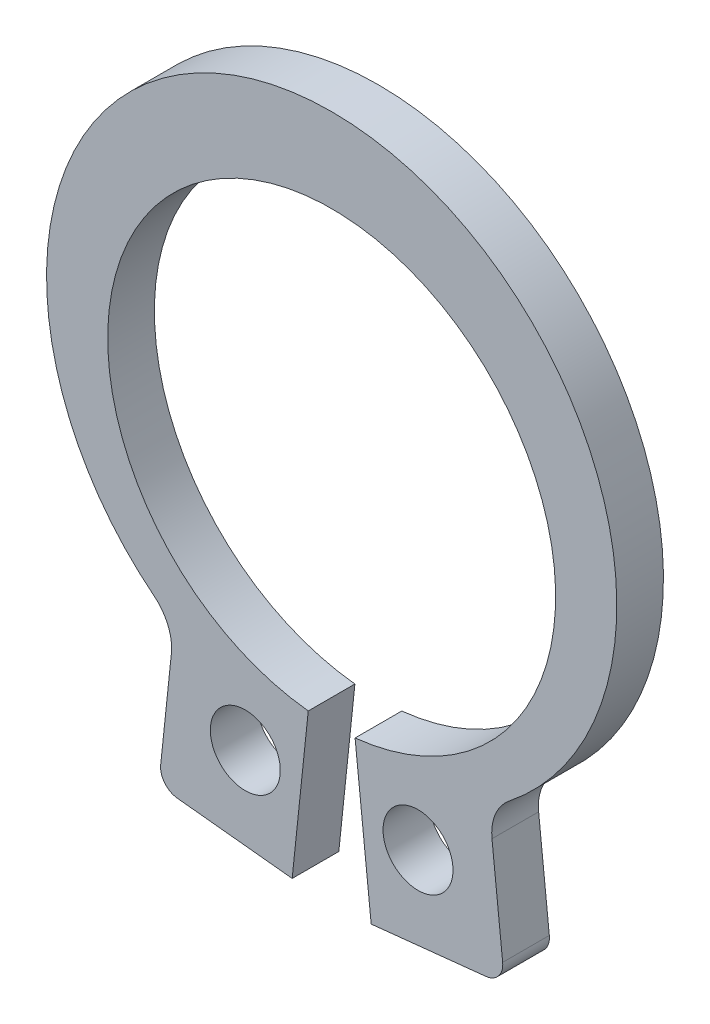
ISO-10303-21;
HEADER;
FILE_DESCRIPTION(('STEP AP214'),'2;1');
FILE_NAME('part.step','',(''),(''),'','','');
FILE_SCHEMA(('AUTOMOTIVE_DESIGN { 1 0 10303 214 1 1 1 1 }'));
ENDSEC;
DATA;
#1=APPLICATION_CONTEXT('core data for automotive mechanical design processes');
#2=APPLICATION_PROTOCOL_DEFINITION('international standard','automotive_design',2000,#1);
#3=PRODUCT_CONTEXT('',#1,'mechanical');
#4=PRODUCT('Part','Part','',(#3));
#5=PRODUCT_RELATED_PRODUCT_CATEGORY('part','',(#4));
#6=PRODUCT_DEFINITION_FORMATION('','',#4);
#7=PRODUCT_DEFINITION_CONTEXT('part definition',#1,'design');
#8=PRODUCT_DEFINITION('design','',#6,#7);
#9=PRODUCT_DEFINITION_SHAPE('','',#8);
#10=(LENGTH_UNIT() NAMED_UNIT(*) SI_UNIT(.MILLI.,.METRE.));
#11=(NAMED_UNIT(*) PLANE_ANGLE_UNIT() SI_UNIT($,.RADIAN.));
#12=(NAMED_UNIT(*) SI_UNIT($,.STERADIAN.) SOLID_ANGLE_UNIT());
#13=UNCERTAINTY_MEASURE_WITH_UNIT(LENGTH_MEASURE(1.E-05),#10,'distance_accuracy_value','');
#14=(GEOMETRIC_REPRESENTATION_CONTEXT(3) GLOBAL_UNCERTAINTY_ASSIGNED_CONTEXT((#13)) GLOBAL_UNIT_ASSIGNED_CONTEXT((#10,
#11,#12)) REPRESENTATION_CONTEXT('',''));
#15=CARTESIAN_POINT('',(0.,0.,0.));
#16=DIRECTION('',(0.,0.,1.));
#17=DIRECTION('',(1.,0.,0.));
#18=AXIS2_PLACEMENT_3D('',#15,#16,#17);
#19=CARTESIAN_POINT('',(0.,0.,1.));
#20=DIRECTION('',(0.,0.,1.));
#21=DIRECTION('',(1.,0.,0.));
#22=AXIS2_PLACEMENT_3D('',#19,#20,#21);
#23=PLANE('',#22);
#24=CARTESIAN_POINT('',(1.85077461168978,-6.17876470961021,1.));
#25=DIRECTION('',(0.,0.,1.));
#26=DIRECTION('',(-1.,0.,0.));
#27=AXIS2_PLACEMENT_3D('',#24,#25,#26);
#28=CIRCLE('',#27,0.75);
#29=CARTESIAN_POINT('',(1.10077461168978,-6.17876470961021,1.));
#30=VERTEX_POINT('',#29);
#31=EDGE_CURVE('E137',#30,#30,#28,.T.);
#32=ORIENTED_EDGE('',*,*,#31,.F.);
#33=EDGE_LOOP('',(#32));
#34=FACE_BOUND('',#33,.T.);
#35=CARTESIAN_POINT('',(0.,0.,1.));
#36=DIRECTION('',(0.,0.,-1.));
#37=DIRECTION('',(1.,0.,0.));
#38=AXIS2_PLACEMENT_3D('',#35,#36,#37);
#39=CIRCLE('',#38,4.8);
#40=CARTESIAN_POINT('',(-0.501736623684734,-4.77370509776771,1.));
#41=VERTEX_POINT('',#40);
#42=CARTESIAN_POINT('',(0.501736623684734,-4.77370509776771,1.));
#43=VERTEX_POINT('',#42);
#44=EDGE_CURVE('E163',#41,#43,#39,.T.);
#45=ORIENTED_EDGE('',*,*,#44,.T.);
#46=DIRECTION('',(0.104528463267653,-0.994521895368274,0.));
#47=VECTOR('',#46,1.);
#48=CARTESIAN_POINT('',(0.846680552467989,-8.05562735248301,1.));
#49=LINE('',#48,#47);
#50=CARTESIAN_POINT('',(0.846680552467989,-8.05562735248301,1.));
#51=VERTEX_POINT('',#50);
#52=EDGE_CURVE('E132',#43,#51,#49,.T.);
#53=ORIENTED_EDGE('',*,*,#52,.T.);
#54=DIRECTION('',(0.994521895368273,0.104528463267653,0.));
#55=VECTOR('',#54,1.);
#56=CARTESIAN_POINT('',(3.30864436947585,-7.79686452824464,1.));
#57=LINE('',#56,#55);
#58=CARTESIAN_POINT('',(3.30864436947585,-7.79686452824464,1.));
#59=VERTEX_POINT('',#58);
#60=EDGE_CURVE('E166',#51,#59,#57,.T.);
#61=ORIENTED_EDGE('',*,*,#60,.T.);
#62=CARTESIAN_POINT('',(3.26683298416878,-7.39905577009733,1.));
#63=DIRECTION('',(0.,0.,1.));
#64=DIRECTION('',(-1.,0.,0.));
#65=AXIS2_PLACEMENT_3D('',#62,#63,#64);
#66=CIRCLE('',#65,0.4);
#67=CARTESIAN_POINT('',(3.66464174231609,-7.35724438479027,1.));
#68=VERTEX_POINT('',#67);
#69=EDGE_CURVE('E168',#59,#68,#66,.T.);
#70=ORIENTED_EDGE('',*,*,#69,.T.);
#71=DIRECTION('',(-0.104528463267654,0.994521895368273,0.));
#72=VECTOR('',#71,1.);
#73=CARTESIAN_POINT('',(3.43551272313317,-5.17722738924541,1.));
#74=LINE('',#73,#72);
#75=CARTESIAN_POINT('',(3.43551272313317,-5.17722738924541,1.));
#76=VERTEX_POINT('',#75);
#77=EDGE_CURVE('E170',#68,#76,#74,.T.);
#78=ORIENTED_EDGE('',*,*,#77,.T.);
#79=CARTESIAN_POINT('',(4.43003461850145,-5.07269892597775,1.));
#80=DIRECTION('',(0.,0.,-1.));
#81=DIRECTION('',(1.,0.,0.));
#82=AXIS2_PLACEMENT_3D('',#79,#80,#81);
#83=CIRCLE('',#82,1.);
#84=CARTESIAN_POINT('',(3.8070214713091,-4.29048756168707,1.));
#85=VERTEX_POINT('',#84);
#86=EDGE_CURVE('E172',#76,#85,#83,.T.);
#87=ORIENTED_EDGE('',*,*,#86,.T.);
#88=CARTESIAN_POINT('',(0.,0.489340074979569,1.));
#89=DIRECTION('',(0.,0.,1.));
#90=DIRECTION('',(-1.,0.,0.));
#91=AXIS2_PLACEMENT_3D('',#88,#89,#90);
#92=CIRCLE('',#91,6.11065992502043);
#93=CARTESIAN_POINT('',(-3.8070214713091,-4.29048756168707,1.));
#94=VERTEX_POINT('',#93);
#95=EDGE_CURVE('E174',#85,#94,#92,.T.);
#96=ORIENTED_EDGE('',*,*,#95,.T.);
#97=CARTESIAN_POINT('',(-4.43003461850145,-5.07269892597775,1.));
#98=DIRECTION('',(0.,0.,-1.));
#99=DIRECTION('',(1.,0.,0.));
#100=AXIS2_PLACEMENT_3D('',#97,#98,#99);
#101=CIRCLE('',#100,1.);
#102=CARTESIAN_POINT('',(-3.43551272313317,-5.17722738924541,1.));
#103=VERTEX_POINT('',#102);
#104=EDGE_CURVE('E176',#94,#103,#101,.T.);
#105=ORIENTED_EDGE('',*,*,#104,.T.);
#106=DIRECTION('',(-0.104528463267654,-0.994521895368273,0.));
#107=VECTOR('',#106,1.);
#108=CARTESIAN_POINT('',(-3.66464174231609,-7.35724438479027,1.));
#109=LINE('',#108,#107);
#110=CARTESIAN_POINT('',(-3.66464174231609,-7.35724438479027,1.));
#111=VERTEX_POINT('',#110);
#112=EDGE_CURVE('E178',#103,#111,#109,.T.);
#113=ORIENTED_EDGE('',*,*,#112,.T.);
#114=CARTESIAN_POINT('',(-3.26683298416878,-7.39905577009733,1.));
#115=DIRECTION('',(0.,0.,1.));
#116=DIRECTION('',(-1.,0.,0.));
#117=AXIS2_PLACEMENT_3D('',#114,#115,#116);
#118=CIRCLE('',#117,0.4);
#119=CARTESIAN_POINT('',(-3.30864436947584,-7.79686452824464,1.));
#120=VERTEX_POINT('',#119);
#121=EDGE_CURVE('E180',#111,#120,#118,.T.);
#122=ORIENTED_EDGE('',*,*,#121,.T.);
#123=DIRECTION('',(0.994521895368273,-0.104528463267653,0.));
#124=VECTOR('',#123,1.);
#125=CARTESIAN_POINT('',(-0.846680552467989,-8.05562735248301,1.));
#126=LINE('',#125,#124);
#127=CARTESIAN_POINT('',(-0.846680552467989,-8.05562735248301,1.));
#128=VERTEX_POINT('',#127);
#129=EDGE_CURVE('E49',#120,#128,#126,.T.);
#130=ORIENTED_EDGE('',*,*,#129,.T.);
#131=DIRECTION('',(0.104528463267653,0.994521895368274,0.));
#132=VECTOR('',#131,1.);
#133=CARTESIAN_POINT('',(-0.501736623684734,-4.77370509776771,1.));
#134=LINE('',#133,#132);
#135=EDGE_CURVE('E44',#128,#41,#134,.T.);
#136=ORIENTED_EDGE('',*,*,#135,.T.);
#137=EDGE_LOOP('',(#45,#53,#61,#70,#78,#87,#96,#105,#113,#122,#130,#136));
#138=FACE_BOUND('',#137,.T.);
#139=CARTESIAN_POINT('',(-1.85077461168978,-6.17876470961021,1.));
#140=DIRECTION('',(0.,0.,1.));
#141=DIRECTION('',(-1.,0.,0.));
#142=AXIS2_PLACEMENT_3D('',#139,#140,#141);
#143=CIRCLE('',#142,0.75);
#144=CARTESIAN_POINT('',(-2.60077461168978,-6.17876470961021,1.));
#145=VERTEX_POINT('',#144);
#146=EDGE_CURVE('E286',#145,#145,#143,.T.);
#147=ORIENTED_EDGE('',*,*,#146,.F.);
#148=EDGE_LOOP('',(#147));
#149=FACE_BOUND('',#148,.T.);
#150=ADVANCED_FACE('F29',(#34,#138,#149),#23,.T.);
#151=CARTESIAN_POINT('',(0.,0.,0.));
#152=DIRECTION('',(0.,0.,1.));
#153=DIRECTION('',(1.,0.,0.));
#154=AXIS2_PLACEMENT_3D('',#151,#152,#153);
#155=PLANE('',#154);
#156=CARTESIAN_POINT('',(1.85077461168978,-6.17876470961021,0.));
#157=DIRECTION('',(0.,0.,1.));
#158=DIRECTION('',(-1.,0.,0.));
#159=AXIS2_PLACEMENT_3D('',#156,#157,#158);
#160=CIRCLE('',#159,0.75);
#161=CARTESIAN_POINT('',(1.10077461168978,-6.17876470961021,0.));
#162=VERTEX_POINT('',#161);
#163=EDGE_CURVE('E140',#162,#162,#160,.T.);
#164=ORIENTED_EDGE('',*,*,#163,.T.);
#165=EDGE_LOOP('',(#164));
#166=FACE_BOUND('',#165,.T.);
#167=CARTESIAN_POINT('',(0.,0.,0.));
#168=DIRECTION('',(0.,0.,-1.));
#169=DIRECTION('',(1.,0.,0.));
#170=AXIS2_PLACEMENT_3D('',#167,#168,#169);
#171=CIRCLE('',#170,4.8);
#172=CARTESIAN_POINT('',(-0.501736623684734,-4.77370509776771,0.));
#173=VERTEX_POINT('',#172);
#174=CARTESIAN_POINT('',(0.501736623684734,-4.77370509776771,0.));
#175=VERTEX_POINT('',#174);
#176=EDGE_CURVE('E123',#173,#175,#171,.T.);
#177=ORIENTED_EDGE('',*,*,#176,.F.);
#178=DIRECTION('',(0.104528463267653,0.994521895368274,0.));
#179=VECTOR('',#178,1.);
#180=CARTESIAN_POINT('',(-0.501736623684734,-4.77370509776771,0.));
#181=LINE('',#180,#179);
#182=CARTESIAN_POINT('',(-0.846680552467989,-8.05562735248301,0.));
#183=VERTEX_POINT('',#182);
#184=EDGE_CURVE('E161',#183,#173,#181,.T.);
#185=ORIENTED_EDGE('',*,*,#184,.F.);
#186=DIRECTION('',(0.994521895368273,-0.104528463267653,0.));
#187=VECTOR('',#186,1.);
#188=CARTESIAN_POINT('',(-0.846680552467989,-8.05562735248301,0.));
#189=LINE('',#188,#187);
#190=CARTESIAN_POINT('',(-3.30864436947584,-7.79686452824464,0.));
#191=VERTEX_POINT('',#190);
#192=EDGE_CURVE('E159',#191,#183,#189,.T.);
#193=ORIENTED_EDGE('',*,*,#192,.F.);
#194=CARTESIAN_POINT('',(-3.26683298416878,-7.39905577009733,0.));
#195=DIRECTION('',(0.,0.,1.));
#196=DIRECTION('',(-1.,0.,0.));
#197=AXIS2_PLACEMENT_3D('',#194,#195,#196);
#198=CIRCLE('',#197,0.4);
#199=CARTESIAN_POINT('',(-3.66464174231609,-7.35724438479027,0.));
#200=VERTEX_POINT('',#199);
#201=EDGE_CURVE('E157',#200,#191,#198,.T.);
#202=ORIENTED_EDGE('',*,*,#201,.F.);
#203=DIRECTION('',(-0.104528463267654,-0.994521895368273,0.));
#204=VECTOR('',#203,1.);
#205=CARTESIAN_POINT('',(-3.66464174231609,-7.35724438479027,0.));
#206=LINE('',#205,#204);
#207=CARTESIAN_POINT('',(-3.43551272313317,-5.17722738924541,0.));
#208=VERTEX_POINT('',#207);
#209=EDGE_CURVE('E155',#208,#200,#206,.T.);
#210=ORIENTED_EDGE('',*,*,#209,.F.);
#211=CARTESIAN_POINT('',(-4.43003461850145,-5.07269892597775,0.));
#212=DIRECTION('',(0.,0.,-1.));
#213=DIRECTION('',(1.,0.,0.));
#214=AXIS2_PLACEMENT_3D('',#211,#212,#213);
#215=CIRCLE('',#214,1.);
#216=CARTESIAN_POINT('',(-3.8070214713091,-4.29048756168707,0.));
#217=VERTEX_POINT('',#216);
#218=EDGE_CURVE('E153',#217,#208,#215,.T.);
#219=ORIENTED_EDGE('',*,*,#218,.F.);
#220=CARTESIAN_POINT('',(0.,0.489340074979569,0.));
#221=DIRECTION('',(0.,0.,1.));
#222=DIRECTION('',(-1.,0.,0.));
#223=AXIS2_PLACEMENT_3D('',#220,#221,#222);
#224=CIRCLE('',#223,6.11065992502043);
#225=CARTESIAN_POINT('',(3.8070214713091,-4.29048756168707,0.));
#226=VERTEX_POINT('',#225);
#227=EDGE_CURVE('E151',#226,#217,#224,.T.);
#228=ORIENTED_EDGE('',*,*,#227,.F.);
#229=CARTESIAN_POINT('',(4.43003461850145,-5.07269892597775,0.));
#230=DIRECTION('',(0.,0.,-1.));
#231=DIRECTION('',(1.,0.,0.));
#232=AXIS2_PLACEMENT_3D('',#229,#230,#231);
#233=CIRCLE('',#232,1.);
#234=CARTESIAN_POINT('',(3.43551272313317,-5.17722738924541,0.));
#235=VERTEX_POINT('',#234);
#236=EDGE_CURVE('E149',#235,#226,#233,.T.);
#237=ORIENTED_EDGE('',*,*,#236,.F.);
#238=DIRECTION('',(-0.104528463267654,0.994521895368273,0.));
#239=VECTOR('',#238,1.);
#240=CARTESIAN_POINT('',(3.43551272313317,-5.17722738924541,0.));
#241=LINE('',#240,#239);
#242=CARTESIAN_POINT('',(3.66464174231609,-7.35724438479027,0.));
#243=VERTEX_POINT('',#242);
#244=EDGE_CURVE('E147',#243,#235,#241,.T.);
#245=ORIENTED_EDGE('',*,*,#244,.F.);
#246=CARTESIAN_POINT('',(3.26683298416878,-7.39905577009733,0.));
#247=DIRECTION('',(0.,0.,1.));
#248=DIRECTION('',(-1.,0.,0.));
#249=AXIS2_PLACEMENT_3D('',#246,#247,#248);
#250=CIRCLE('',#249,0.4);
#251=CARTESIAN_POINT('',(3.30864436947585,-7.79686452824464,0.));
#252=VERTEX_POINT('',#251);
#253=EDGE_CURVE('E145',#252,#243,#250,.T.);
#254=ORIENTED_EDGE('',*,*,#253,.F.);
#255=DIRECTION('',(0.994521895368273,0.104528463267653,0.));
#256=VECTOR('',#255,1.);
#257=CARTESIAN_POINT('',(3.30864436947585,-7.79686452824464,0.));
#258=LINE('',#257,#256);
#259=CARTESIAN_POINT('',(0.846680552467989,-8.05562735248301,0.));
#260=VERTEX_POINT('',#259);
#261=EDGE_CURVE('E125',#260,#252,#258,.T.);
#262=ORIENTED_EDGE('',*,*,#261,.F.);
#263=DIRECTION('',(0.104528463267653,-0.994521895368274,0.));
#264=VECTOR('',#263,1.);
#265=CARTESIAN_POINT('',(0.846680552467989,-8.05562735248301,0.));
#266=LINE('',#265,#264);
#267=EDGE_CURVE('E118',#175,#260,#266,.T.);
#268=ORIENTED_EDGE('',*,*,#267,.F.);
#269=EDGE_LOOP('',(#177,#185,#193,#202,#210,#219,#228,#237,#245,#254,#262,#268));
#270=FACE_BOUND('',#269,.T.);
#271=CARTESIAN_POINT('',(-1.85077461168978,-6.17876470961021,0.));
#272=DIRECTION('',(0.,0.,1.));
#273=DIRECTION('',(-1.,0.,0.));
#274=AXIS2_PLACEMENT_3D('',#271,#272,#273);
#275=CIRCLE('',#274,0.75);
#276=CARTESIAN_POINT('',(-2.60077461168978,-6.17876470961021,0.));
#277=VERTEX_POINT('',#276);
#278=EDGE_CURVE('E283',#277,#277,#275,.T.);
#279=ORIENTED_EDGE('',*,*,#278,.T.);
#280=EDGE_LOOP('',(#279));
#281=FACE_BOUND('',#280,.T.);
#282=ADVANCED_FACE('F119',(#166,#270,#281),#155,.F.);
#283=CARTESIAN_POINT('',(0.,0.,1.));
#284=DIRECTION('',(0.,0.,-1.));
#285=DIRECTION('',(-1.,0.,0.));
#286=AXIS2_PLACEMENT_3D('',#283,#284,#285);
#287=CYLINDRICAL_SURFACE('',#286,4.8);
#288=ORIENTED_EDGE('',*,*,#176,.T.);
#289=DIRECTION('',(0.,0.,-1.));
#290=VECTOR('',#289,1.);
#291=CARTESIAN_POINT('',(0.501736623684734,-4.77370509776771,1.));
#292=LINE('',#291,#290);
#293=EDGE_CURVE('E11',#43,#175,#292,.T.);
#294=ORIENTED_EDGE('',*,*,#293,.F.);
#295=ORIENTED_EDGE('',*,*,#44,.F.);
#296=DIRECTION('',(0.,0.,-1.));
#297=VECTOR('',#296,1.);
#298=CARTESIAN_POINT('',(-0.501736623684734,-4.77370509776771,1.));
#299=LINE('',#298,#297);
#300=EDGE_CURVE('E136',#41,#173,#299,.T.);
#301=ORIENTED_EDGE('',*,*,#300,.T.);
#302=EDGE_LOOP('',(#288,#294,#295,#301));
#303=FACE_BOUND('',#302,.T.);
#304=ADVANCED_FACE('F31',(#303),#287,.F.);
#305=CARTESIAN_POINT('',(0.846680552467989,-8.05562735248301,1.));
#306=DIRECTION('',(0.994521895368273,0.104528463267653,0.));
#307=DIRECTION('',(-0.104528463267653,0.994521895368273,0.));
#308=AXIS2_PLACEMENT_3D('',#305,#306,#307);
#309=PLANE('',#308);
#310=ORIENTED_EDGE('',*,*,#267,.T.);
#311=DIRECTION('',(0.,0.,-1.));
#312=VECTOR('',#311,1.);
#313=CARTESIAN_POINT('',(0.846680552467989,-8.05562735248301,1.));
#314=LINE('',#313,#312);
#315=EDGE_CURVE('E37',#51,#260,#314,.T.);
#316=ORIENTED_EDGE('',*,*,#315,.F.);
#317=ORIENTED_EDGE('',*,*,#52,.F.);
#318=ORIENTED_EDGE('',*,*,#293,.T.);
#319=EDGE_LOOP('',(#310,#316,#317,#318));
#320=FACE_BOUND('',#319,.T.);
#321=ADVANCED_FACE('F131',(#320),#309,.F.);
#322=CARTESIAN_POINT('',(3.30864436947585,-7.79686452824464,1.));
#323=DIRECTION('',(-0.104528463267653,0.994521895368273,0.));
#324=DIRECTION('',(-0.994521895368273,-0.104528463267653,0.));
#325=AXIS2_PLACEMENT_3D('',#322,#323,#324);
#326=PLANE('',#325);
#327=ORIENTED_EDGE('',*,*,#261,.T.);
#328=DIRECTION('',(0.,0.,-1.));
#329=VECTOR('',#328,1.);
#330=CARTESIAN_POINT('',(3.30864436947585,-7.79686452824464,1.));
#331=LINE('',#330,#329);
#332=EDGE_CURVE('E209',#59,#252,#331,.T.);
#333=ORIENTED_EDGE('',*,*,#332,.F.);
#334=ORIENTED_EDGE('',*,*,#60,.F.);
#335=ORIENTED_EDGE('',*,*,#315,.T.);
#336=EDGE_LOOP('',(#327,#333,#334,#335));
#337=FACE_BOUND('',#336,.T.);
#338=ADVANCED_FACE('F213',(#337),#326,.F.);
#339=CARTESIAN_POINT('',(3.26683298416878,-7.39905577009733,1.));
#340=DIRECTION('',(0.,0.,-1.));
#341=DIRECTION('',(-1.,0.,0.));
#342=AXIS2_PLACEMENT_3D('',#339,#340,#341);
#343=CYLINDRICAL_SURFACE('',#342,0.4);
#344=ORIENTED_EDGE('',*,*,#253,.T.);
#345=DIRECTION('',(0.,0.,-1.));
#346=VECTOR('',#345,1.);
#347=CARTESIAN_POINT('',(3.66464174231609,-7.35724438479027,1.));
#348=LINE('',#347,#346);
#349=EDGE_CURVE('E206',#68,#243,#348,.T.);
#350=ORIENTED_EDGE('',*,*,#349,.F.);
#351=ORIENTED_EDGE('',*,*,#69,.F.);
#352=ORIENTED_EDGE('',*,*,#332,.T.);
#353=EDGE_LOOP('',(#344,#350,#351,#352));
#354=FACE_BOUND('',#353,.T.);
#355=ADVANCED_FACE('F221',(#354),#343,.T.);
#356=CARTESIAN_POINT('',(3.43551272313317,-5.17722738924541,1.));
#357=DIRECTION('',(-0.994521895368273,-0.104528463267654,0.));
#358=DIRECTION('',(0.104528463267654,-0.994521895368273,0.));
#359=AXIS2_PLACEMENT_3D('',#356,#357,#358);
#360=PLANE('',#359);
#361=ORIENTED_EDGE('',*,*,#244,.T.);
#362=DIRECTION('',(0.,0.,-1.));
#363=VECTOR('',#362,1.);
#364=CARTESIAN_POINT('',(3.43551272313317,-5.17722738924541,1.));
#365=LINE('',#364,#363);
#366=EDGE_CURVE('E203',#76,#235,#365,.T.);
#367=ORIENTED_EDGE('',*,*,#366,.F.);
#368=ORIENTED_EDGE('',*,*,#77,.F.);
#369=ORIENTED_EDGE('',*,*,#349,.T.);
#370=EDGE_LOOP('',(#361,#367,#368,#369));
#371=FACE_BOUND('',#370,.T.);
#372=ADVANCED_FACE('F224',(#371),#360,.F.);
#373=CARTESIAN_POINT('',(4.43003461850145,-5.07269892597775,1.));
#374=DIRECTION('',(0.,0.,-1.));
#375=DIRECTION('',(-1.,0.,0.));
#376=AXIS2_PLACEMENT_3D('',#373,#374,#375);
#377=CYLINDRICAL_SURFACE('',#376,1.);
#378=ORIENTED_EDGE('',*,*,#236,.T.);
#379=DIRECTION('',(0.,0.,-1.));
#380=VECTOR('',#379,1.);
#381=CARTESIAN_POINT('',(3.8070214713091,-4.29048756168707,1.));
#382=LINE('',#381,#380);
#383=EDGE_CURVE('E200',#85,#226,#382,.T.);
#384=ORIENTED_EDGE('',*,*,#383,.F.);
#385=ORIENTED_EDGE('',*,*,#86,.F.);
#386=ORIENTED_EDGE('',*,*,#366,.T.);
#387=EDGE_LOOP('',(#378,#384,#385,#386));
#388=FACE_BOUND('',#387,.T.);
#389=ADVANCED_FACE('F229',(#388),#377,.F.);
#390=CARTESIAN_POINT('',(0.,0.489340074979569,1.));
#391=DIRECTION('',(0.,0.,-1.));
#392=DIRECTION('',(-1.,0.,0.));
#393=AXIS2_PLACEMENT_3D('',#390,#391,#392);
#394=CYLINDRICAL_SURFACE('',#393,6.11065992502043);
#395=ORIENTED_EDGE('',*,*,#227,.T.);
#396=DIRECTION('',(0.,0.,-1.));
#397=VECTOR('',#396,1.);
#398=CARTESIAN_POINT('',(-3.8070214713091,-4.29048756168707,1.));
#399=LINE('',#398,#397);
#400=EDGE_CURVE('E197',#94,#217,#399,.T.);
#401=ORIENTED_EDGE('',*,*,#400,.F.);
#402=ORIENTED_EDGE('',*,*,#95,.F.);
#403=ORIENTED_EDGE('',*,*,#383,.T.);
#404=EDGE_LOOP('',(#395,#401,#402,#403));
#405=FACE_BOUND('',#404,.T.);
#406=ADVANCED_FACE('F235',(#405),#394,.T.);
#407=CARTESIAN_POINT('',(-4.43003461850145,-5.07269892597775,1.));
#408=DIRECTION('',(0.,0.,-1.));
#409=DIRECTION('',(-1.,0.,0.));
#410=AXIS2_PLACEMENT_3D('',#407,#408,#409);
#411=CYLINDRICAL_SURFACE('',#410,1.);
#412=ORIENTED_EDGE('',*,*,#218,.T.);
#413=DIRECTION('',(0.,0.,-1.));
#414=VECTOR('',#413,1.);
#415=CARTESIAN_POINT('',(-3.43551272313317,-5.17722738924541,1.));
#416=LINE('',#415,#414);
#417=EDGE_CURVE('E194',#103,#208,#416,.T.);
#418=ORIENTED_EDGE('',*,*,#417,.F.);
#419=ORIENTED_EDGE('',*,*,#104,.F.);
#420=ORIENTED_EDGE('',*,*,#400,.T.);
#421=EDGE_LOOP('',(#412,#418,#419,#420));
#422=FACE_BOUND('',#421,.T.);
#423=ADVANCED_FACE('F239',(#422),#411,.F.);
#424=CARTESIAN_POINT('',(-3.66464174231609,-7.35724438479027,1.));
#425=DIRECTION('',(0.994521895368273,-0.104528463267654,0.));
#426=DIRECTION('',(0.104528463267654,0.994521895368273,0.));
#427=AXIS2_PLACEMENT_3D('',#424,#425,#426);
#428=PLANE('',#427);
#429=ORIENTED_EDGE('',*,*,#209,.T.);
#430=DIRECTION('',(0.,0.,-1.));
#431=VECTOR('',#430,1.);
#432=CARTESIAN_POINT('',(-3.66464174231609,-7.35724438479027,1.));
#433=LINE('',#432,#431);
#434=EDGE_CURVE('E191',#111,#200,#433,.T.);
#435=ORIENTED_EDGE('',*,*,#434,.F.);
#436=ORIENTED_EDGE('',*,*,#112,.F.);
#437=ORIENTED_EDGE('',*,*,#417,.T.);
#438=EDGE_LOOP('',(#429,#435,#436,#437));
#439=FACE_BOUND('',#438,.T.);
#440=ADVANCED_FACE('F244',(#439),#428,.F.);
#441=CARTESIAN_POINT('',(-3.26683298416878,-7.39905577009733,1.));
#442=DIRECTION('',(0.,0.,-1.));
#443=DIRECTION('',(-1.,0.,0.));
#444=AXIS2_PLACEMENT_3D('',#441,#442,#443);
#445=CYLINDRICAL_SURFACE('',#444,0.4);
#446=ORIENTED_EDGE('',*,*,#201,.T.);
#447=DIRECTION('',(0.,0.,-1.));
#448=VECTOR('',#447,1.);
#449=CARTESIAN_POINT('',(-3.30864436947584,-7.79686452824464,1.));
#450=LINE('',#449,#448);
#451=EDGE_CURVE('E188',#120,#191,#450,.T.);
#452=ORIENTED_EDGE('',*,*,#451,.F.);
#453=ORIENTED_EDGE('',*,*,#121,.F.);
#454=ORIENTED_EDGE('',*,*,#434,.T.);
#455=EDGE_LOOP('',(#446,#452,#453,#454));
#456=FACE_BOUND('',#455,.T.);
#457=ADVANCED_FACE('F248',(#456),#445,.T.);
#458=CARTESIAN_POINT('',(-0.846680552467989,-8.05562735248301,1.));
#459=DIRECTION('',(0.104528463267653,0.994521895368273,0.));
#460=DIRECTION('',(-0.994521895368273,0.104528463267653,0.));
#461=AXIS2_PLACEMENT_3D('',#458,#459,#460);
#462=PLANE('',#461);
#463=ORIENTED_EDGE('',*,*,#192,.T.);
#464=DIRECTION('',(0.,0.,-1.));
#465=VECTOR('',#464,1.);
#466=CARTESIAN_POINT('',(-0.846680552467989,-8.05562735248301,1.));
#467=LINE('',#466,#465);
#468=EDGE_CURVE('E185',#128,#183,#467,.T.);
#469=ORIENTED_EDGE('',*,*,#468,.F.);
#470=ORIENTED_EDGE('',*,*,#129,.F.);
#471=ORIENTED_EDGE('',*,*,#451,.T.);
#472=EDGE_LOOP('',(#463,#469,#470,#471));
#473=FACE_BOUND('',#472,.T.);
#474=ADVANCED_FACE('F252',(#473),#462,.F.);
#475=CARTESIAN_POINT('',(-0.501736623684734,-4.77370509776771,1.));
#476=DIRECTION('',(-0.994521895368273,0.104528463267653,0.));
#477=DIRECTION('',(-0.104528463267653,-0.994521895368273,0.));
#478=AXIS2_PLACEMENT_3D('',#475,#476,#477);
#479=PLANE('',#478);
#480=ORIENTED_EDGE('',*,*,#184,.T.);
#481=ORIENTED_EDGE('',*,*,#300,.F.);
#482=ORIENTED_EDGE('',*,*,#135,.F.);
#483=ORIENTED_EDGE('',*,*,#468,.T.);
#484=EDGE_LOOP('',(#480,#481,#482,#483));
#485=FACE_BOUND('',#484,.T.);
#486=ADVANCED_FACE('F254',(#485),#479,.F.);
#487=CARTESIAN_POINT('',(1.85077461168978,-6.17876470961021,1.));
#488=DIRECTION('',(0.,0.,-1.));
#489=DIRECTION('',(-1.,0.,0.));
#490=AXIS2_PLACEMENT_3D('',#487,#488,#489);
#491=CYLINDRICAL_SURFACE('',#490,0.75);
#492=ORIENTED_EDGE('',*,*,#163,.F.);
#493=EDGE_LOOP('',(#492));
#494=FACE_BOUND('',#493,.T.);
#495=ORIENTED_EDGE('',*,*,#31,.T.);
#496=EDGE_LOOP('',(#495));
#497=FACE_BOUND('',#496,.T.);
#498=ADVANCED_FACE('F256',(#494,#497),#491,.F.);
#499=CARTESIAN_POINT('',(-1.85077461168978,-6.17876470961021,1.));
#500=DIRECTION('',(0.,0.,-1.));
#501=DIRECTION('',(-1.,0.,0.));
#502=AXIS2_PLACEMENT_3D('',#499,#500,#501);
#503=CYLINDRICAL_SURFACE('',#502,0.75);
#504=ORIENTED_EDGE('',*,*,#278,.F.);
#505=EDGE_LOOP('',(#504));
#506=FACE_BOUND('',#505,.T.);
#507=ORIENTED_EDGE('',*,*,#146,.T.);
#508=EDGE_LOOP('',(#507));
#509=FACE_BOUND('',#508,.T.);
#510=ADVANCED_FACE('F262',(#506,#509),#503,.F.);
#511=CLOSED_SHELL('',(#150,#282,#304,#321,#338,#355,#372,#389,#406,#423,#440,#457,#474,#486,
#498,#510));
#512=MANIFOLD_SOLID_BREP('B2',#511);
#513=ADVANCED_BREP_SHAPE_REPRESENTATION('',(#18,#512),#14);
#514=SHAPE_DEFINITION_REPRESENTATION(#9,#513);
ENDSEC;
END-ISO-10303-21;
